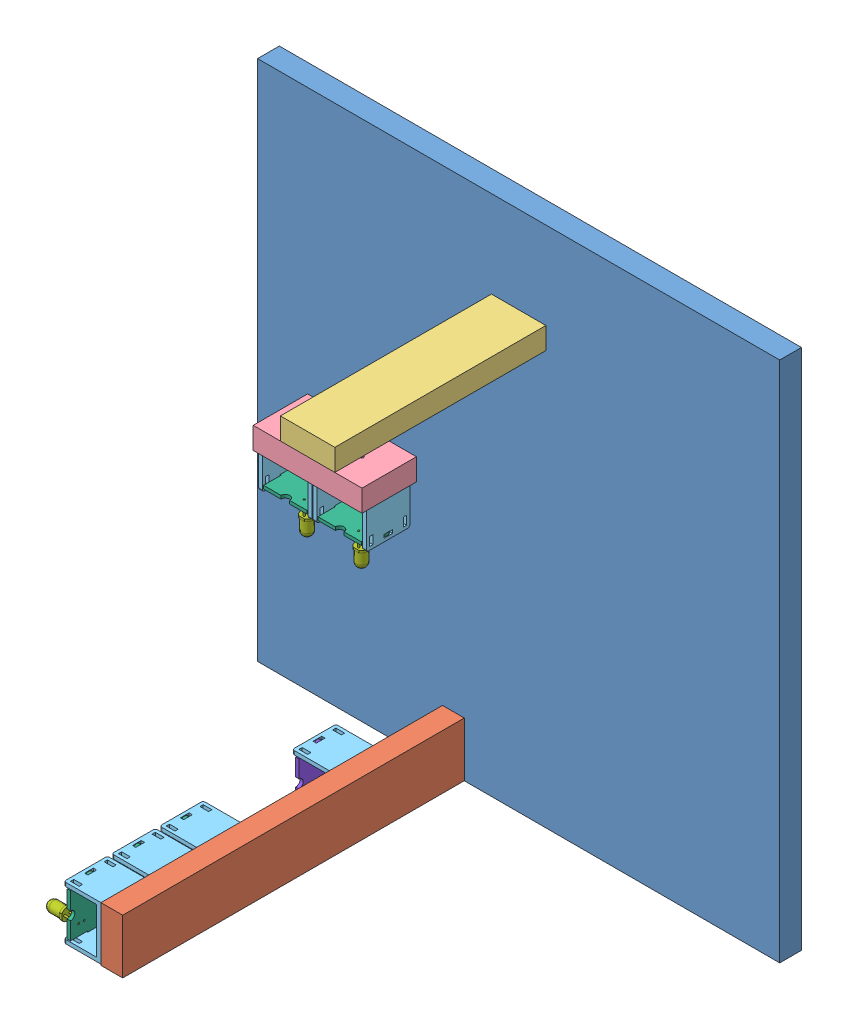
SolidWorks assembly Assemblage_maquette_feux.SLDASM, configuration Défaut (file format 8000). Lengths in mm.
Overall size (240 240 167).
26 component instances, 8 part files, 45 mates.
Components (placement in the parent):
- socle-1: socle.SLDPRT [Défaut] at (-134.8436 -81.1894 -5) size (240 240 10)
- mat_feux_voitures-1: mat_feux_voitures.SLDPRT [Défaut] at (-49.8436 -81.1894 2) x (0 1 0) z (1 0 0) size (25 160 10)
- mat_feux_pietons-1: mat_feux_pietons.SLDPRT [Défaut] at (-27.3436 118.8106 2) x (1 0 0) z (0 -1 0) size (25 100 10)
- support_feux_pietons-1: support_feux_pietons.SLDPRT [Défaut] at (-39.8436 108.8106 77) x (1 0 0) z (0 -1 0) size (50 25 10)
- support_01-1: support_01.SLDPRT [Défaut] at (-49.8436 -80.6894 142) x (0 1 0) z (0 0 1) size (24.5 17 20)
- support_01-2: support_01.SLDPRT [Défaut] at (-49.8436 -80.6894 120) x (0 1 0) z (0 0 1) size (24.5 17 20)
- support_01-3: support_01.SLDPRT [Défaut] at (-49.8436 -80.6894 98) x (0 1 0) z (0 0 1) size (24.5 17 20)
- support_01-4: support_01.SLDPRT [Défaut] at (-49.8436 -80.6894 37) x (0 1 0) z (0 0 1) size (24.5 17 20)
- support_01-5: support_01.SLDPRT [Défaut] at (9.6564 98.8106 79.5) x (-1 0 0) z (0 0 1) size (24.5 17 20)
- support_01-6: support_01.SLDPRT [Défaut] at (-15.3436 98.8106 79.5) x (-1 0 0) z (0 0 1) size (24.5 17 20)
- Assemblage_support+led-1: Assemblage_support+led.SLDASM [Défaut] at (-64.5936 -149.0811 144.8033) x (0 -1 0) z (-1 0 0) size (24 20 15)
  - support_led-1: support_led.SLDPRT [Défaut] at (-90.6417 -2.8033 -0.75) size (24 20 1.5)
  - DEL D5-1: DEL D5.SLDPRT [Défaut] at (-75.6417 12.1967 14.25) x (0 1 0) z (0 0 -1) size (5.3 5.6 15)
- Assemblage_support+led-2: Assemblage_support+led.SLDASM [Défaut] at (-64.5936 -149.0811 122.8033) x (0 -1 0) z (-1 0 0) size (24 20 15)
  - support_led-1: support_led.SLDPRT [Défaut] at (-90.6417 -2.8033 -0.75) size (24 20 1.5)
  - DEL D5-1: DEL D5.SLDPRT [Défaut] at (-75.6417 12.1967 14.25) x (0 1 0) z (0 0 -1) size (5.3 5.6 15)
- Assemblage_support+led-3: Assemblage_support+led.SLDASM [Défaut] at (-64.5936 -149.0811 100.8033) x (0 -1 0) z (-1 0 0) size (24 20 15)
  - support_led-1: support_led.SLDPRT [Défaut] at (-90.6417 -2.8033 -0.75) size (24 20 1.5)
  - DEL D5-1: DEL D5.SLDPRT [Défaut] at (-75.6417 12.1967 14.25) x (0 1 0) z (0 0 -1) size (5.3 5.6 15)
- Assemblage_support+led-4: Assemblage_support+led.SLDASM [Défaut] at (53.0481 84.0606 82.3033) x (1 0 0) z (0 -1 0) size (24 20 15)
  - support_led-1: support_led.SLDPRT [Défaut] at (-90.6417 -2.8033 -0.75) size (24 20 1.5)
  - DEL D5-1: DEL D5.SLDPRT [Défaut] at (-75.6417 12.1967 14.25) x (0 1 0) z (0 0 -1) size (5.3 5.6 15)
- Assemblage_support+led-5: Assemblage_support+led.SLDASM [Défaut] at (78.0481 84.0606 82.3033) x (1 0 0) z (0 -1 0) size (24 20 15)
  - support_led-1: support_led.SLDPRT [Défaut] at (-90.6417 -2.8033 -0.75) size (24 20 1.5)
  - DEL D5-1: DEL D5.SLDPRT [Défaut] at (-75.6417 12.1967 14.25) x (0 1 0) z (0 0 -1) size (5.3 5.6 15)
- support_bp-1: support_bp.SLDPRT [Défaut] at (-63.8436 -58.4394 37) x (0 -1 0) z (-1 0 0) size (24 20 6.5)
Mates (geometry in assembly coordinates):
- Coaxiale1: concentric aligned: circle of socle-1; circle of mat_feux_voitures-1
- Coïncidente1: coincident anti-aligned: plane of socle-1 through (-134.8436 -81.1894 2) normal (0 0 1); plane of mat_feux_voitures-1 through (-39.8436 -81.1894 2) normal (0 0 -1)
- Coïncidente4: coincident aligned: line of socle-1 through (-39.8436 -81.1894 2) axis (0 1 0); line of mat_feux_voitures-1 through (-39.8436 -81.1894 2) axis (0 1 0)
- Coaxiale2: concentric aligned: circle of socle-1; circle of mat_feux_pietons-1
- Parallèle2: parallel aligned: line of socle-1 through (-27.3436 108.8106 5) axis (1 0 0); line of mat_feux_pietons-1 through (-27.3436 108.8106 2) axis (1 0 0)
- Coïncidente6: coincident anti-aligned: plane of socle-1 through (-134.8436 -81.1894 2) normal (0 0 1); plane of mat_feux_pietons-1 through (-27.3436 108.8106 2) normal (0 0 -1)
- Coaxiale3: concentric aligned: circle of mat_feux_pietons-1; circle of support_feux_pietons-1
- Coïncidente7: coincident aligned: line of support_feux_pietons-1 through (10.1564 108.8106 102) axis (-1 0 0); line of mat_feux_pietons-1 through (-2.3436 108.8106 102) axis (-1 0 0)
- Coaxiale4: concentric aligned: circle of support_feux_pietons-1; circle of support_01-5
- Parallèle3: parallel aligned: plane of support_feux_pietons-1 through (-39.8436 98.8106 77) normal (-1 0 0); plane of support_01-5 through (-14.8436 98.8106 99.5) normal (-1 0 0)
- Coïncidente9: coincident anti-aligned: plane of support_feux_pietons-1 through (-39.8436 98.8106 77) normal (0 -1 0); plane of support_01-5 through (9.6564 98.8106 99.5) normal (0 1 0)
- Coaxiale5: concentric aligned: circle of support_feux_pietons-1; circle of support_01-6
- Parallèle4: parallel aligned: plane of support_feux_pietons-1 through (-39.8436 98.8106 77) normal (-1 0 0); plane of support_01-6 through (-39.8436 98.8106 99.5) normal (-1 0 0)
- Coïncidente11: coincident anti-aligned: plane of support_feux_pietons-1 through (-39.8436 98.8106 77) normal (0 -1 0); plane of support_01-6 through (-15.3436 98.8106 99.5) normal (0 1 0)
- Coaxiale6: concentric aligned: circle of mat_feux_voitures-1; circle of support_01-1
- Parallèle5: parallel aligned: plane of mat_feux_voitures-1 through (-39.8436 -81.1894 2) normal (0 -1 0); plane of support_01-1 through (-66.8436 -80.6894 162) normal (0 -1 0)
- Coïncidente13: coincident anti-aligned: plane of mat_feux_voitures-1 through (-49.8436 -81.1894 2) normal (-1 0 0); plane of support_01-1 through (-49.8436 -80.6894 162) normal (1 0 0)
- Coaxiale7: concentric aligned: circle of mat_feux_voitures-1; circle of support_01-2
- Parallèle6: parallel aligned: plane of mat_feux_voitures-1 through (-39.8436 -81.1894 2) normal (0 -1 0); plane of support_01-2 through (-66.8436 -80.6894 140) normal (0 -1 0)
- Coïncidente15: coincident anti-aligned: plane of mat_feux_voitures-1 through (-49.8436 -81.1894 2) normal (-1 0 0); plane of support_01-2 through (-49.8436 -80.6894 140) normal (1 0 0)
- Coaxiale8: concentric aligned: circle of mat_feux_voitures-1; circle of support_01-3
- Parallèle7: parallel aligned: plane of mat_feux_voitures-1 through (-39.8436 -81.1894 2) normal (0 -1 0); plane of support_01-3 through (-66.8436 -80.6894 118) normal (0 -1 0)
- Coïncidente17: coincident anti-aligned: plane of mat_feux_voitures-1 through (-49.8436 -81.1894 2) normal (-1 0 0); plane of support_01-3 through (-49.8436 -80.6894 118) normal (1 0 0)
- Coaxiale9: concentric aligned: circle of mat_feux_voitures-1; circle of support_01-4
- Parallèle8: parallel aligned: plane of mat_feux_voitures-1 through (-39.8436 -81.1894 2) normal (0 -1 0); plane of support_01-4 through (-66.8436 -80.6894 57) normal (0 -1 0)
- Coïncidente20: coincident anti-aligned: plane of mat_feux_voitures-1 through (-49.8436 -81.1894 2) normal (-1 0 0); plane of support_01-4 through (-49.8436 -80.6894 57) normal (1 0 0)
- Coïncidente21: coincident anti-aligned: plane of support_01-1 through (-63.8436 -86.1894 154) normal (-1 0 0); plane of Assemblage_support+led-1/support_led-1 through (-63.8436 -58.4394 152) normal (1 0 0)
- Parallèle9: parallel aligned: plane of support_01-1 through (-49.8436 -80.6894 142) normal (0 0 -1); plane of Assemblage_support+led-1/support_led-1 through (-65.3436 -58.4394 142) normal (0 0 -1)
- Distance1: distance = 0.5 mm anti-aligned: plane of Assemblage_support+led-1/support_led-1 through (-65.3436 -78.4394 142) normal (0 -1 0); plane of support_01-1 through (-51.8436 -78.9394 162) normal (0 1 0)
- Coïncidente24: coincident aligned: plane of support_01-1 through (-49.8436 -80.6894 162) normal (0 0 1); plane of Assemblage_support+led-1/support_led-1 through (-65.3436 -58.4394 162) normal (0 0 1)
- Coïncidente25: coincident anti-aligned: plane of support_01-2 through (-63.8436 -86.1894 132) normal (-1 0 0); plane of Assemblage_support+led-2/support_led-1 through (-63.8436 -58.4394 130) normal (1 0 0)
- Coïncidente26: coincident aligned: plane of support_01-2 through (-49.8436 -80.6894 120) normal (0 0 -1); plane of Assemblage_support+led-2/support_led-1 through (-65.3436 -58.4394 120) normal (0 0 -1)
- Distance2: distance = 0.5 mm anti-aligned: plane of support_01-2 through (-66.8436 -57.9394 140) normal (0 -1 0); plane of Assemblage_support+led-2/support_led-1 through (-65.3436 -58.4394 120) normal (0 1 0)
- Coïncidente28: coincident anti-aligned: plane of support_01-3 through (-63.8436 -86.1894 110) normal (-1 0 0); plane of Assemblage_support+led-3/support_led-1 through (-63.8436 -58.4394 108) normal (1 0 0)
- Coïncidente29: coincident aligned: plane of support_01-3 through (-49.8436 -80.6894 98) normal (0 0 -1); plane of Assemblage_support+led-3/support_led-1 through (-65.3436 -58.4394 98) normal (0 0 -1)
- Distance3: distance = 0.5 mm anti-aligned: plane of support_01-3 through (-66.8436 -57.9394 118) normal (0 -1 0); plane of Assemblage_support+led-3/support_led-1 through (-65.3436 -58.4394 98) normal (0 1 0)
- Coïncidente31: coincident anti-aligned: plane of support_01-5 through (15.1564 84.8106 91.5) normal (0 -1 0); plane of Assemblage_support+led-5/support_led-1 through (-12.5936 84.8106 89.5) normal (0 1 0)
- Coïncidente32: coincident aligned: plane of support_01-5 through (9.6564 98.8106 79.5) normal (0 0 -1); plane of Assemblage_support+led-5/support_led-1 through (-12.5936 83.3106 79.5) normal (0 0 -1)
- Distance4: distance = 0.5 mm anti-aligned: plane of Assemblage_support+led-5/support_led-1 through (-12.5936 83.3106 79.5) normal (-1 0 0); plane of support_01-5 through (-13.0936 81.8106 99.5) normal (1 0 0)
- Coïncidente34: coincident anti-aligned: plane of support_01-6 through (-9.8436 84.8106 91.5) normal (0 -1 0); plane of Assemblage_support+led-4/support_led-1 through (-37.5936 84.8106 89.5) normal (0 1 0)
- Coïncidente35: coincident aligned: plane of support_01-6 through (-15.3436 98.8106 79.5) normal (0 0 -1); plane of Assemblage_support+led-4/support_led-1 through (-37.5936 83.3106 79.5) normal (0 0 -1)
- Distance5: distance = 0.5 mm anti-aligned: plane of support_01-6 through (-38.0936 81.8106 99.5) normal (1 0 0); plane of Assemblage_support+led-4/support_led-1 through (-37.5936 83.3106 79.5) normal (-1 0 0)
- Coïncidente37: coincident anti-aligned: plane of support_01-4 through (-63.8436 -86.1894 49) normal (-1 0 0); plane of support_bp-1 through (-63.8436 -57.4394 47) normal (1 0 0)
- Coïncidente39: coincident aligned: plane of support_01-4 through (-49.8436 -80.6894 57) normal (0 0 1); plane of support_bp-1 through (-65.3436 -57.4394 57) normal (0 0 1)
- Distance6: distance = 0.5 mm anti-aligned: plane of support_01-4 through (-66.8436 -57.9394 57) normal (0 -1 0); plane of support_bp-1 through (-65.3436 -58.4394 37) normal (0 1 0)
